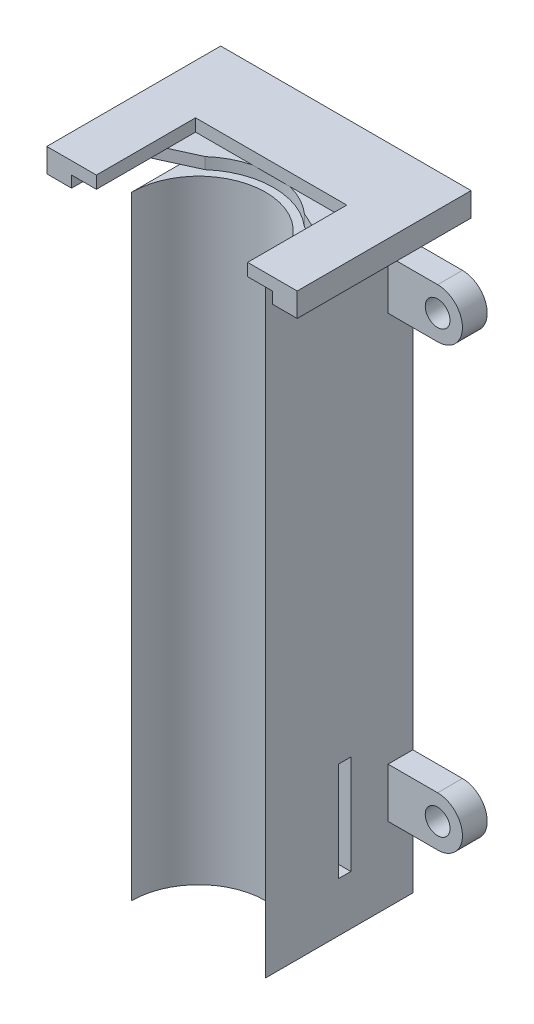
from build123d import *

# Parameters (mm, degrees)
BOSS_EXTRUDE1_DEPTH = 2.921
BOSS_EXTRUDE2_DEPTH = 3.175
BOSS_EXTRUDE3_DEPTH = 157.1625
SKETCH4_R           = 3.175
BOSS_EXTRUDE4_DEPTH = 6.35
SKETCH8_W           = 3.175
SKETCH8_H           = 25.4
CUT_EXTRUDE2_DEPTH  = 1641.301720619


with BuildPart() as part:
    # Sketch1 → Boss-Extrude1 (new body)
    with BuildSketch(Plane(origin=(0, 1004.350361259, 0), x_dir=(1, 0, 0), z_dir=(0, 1, 0))):
        with BuildLine():
            Line((357.540693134, -1279.66945996), (357.540693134, -1293.304768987))
            Line((357.540693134, -1293.304768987), (351.190693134, -1293.304768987))
            Line((351.190693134, -1293.304768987), (351.190693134, -1248.763034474))
            Line((351.190693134, -1248.763034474), (415.325693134, -1248.763034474))
            Line((415.325693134, -1248.763034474), (415.325693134, -1293.304768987))
            Line((415.325693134, -1293.304768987), (408.975693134, -1293.304768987))
            Line((408.975693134, -1293.304768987), (408.975693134, -1279.66945996))
            ThreePointArc((408.975693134, -1279.66945996), (408.572843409, -1278.296802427), (407.492079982, -1277.359558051))
            Line((407.492079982, -1277.359558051), (395.959386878, -1272.085314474))
            ThreePointArc((395.959386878, -1272.085314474), (383.258193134, -1267.284714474), (370.55699939, -1272.085314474))
            Line((370.55699939, -1272.085314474), (359.024306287, -1277.359558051))
            ThreePointArc((359.024306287, -1277.359558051), (357.94354286, -1278.296802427), (357.540693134, -1279.66945996))
        make_face()
    extrude(amount=-BOSS_EXTRUDE1_DEPTH)

    # Sketch2 → Boss-Extrude2 (add)
    with BuildSketch(Plane(origin=(0, 1004.350361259, 0), x_dir=(1, 0, 0), z_dir=(0, 1, 0))):
        Polygon((415.325693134, -1293.304768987), (402.625693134, -1293.304768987), (402.625693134, -1267.904768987), (363.890693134, -1267.904768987), (363.890693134, -1293.304768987), (351.190693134, -1293.304768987), (351.190693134, -1248.763034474), (415.325693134, -1248.763034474), align=None)
    extrude(amount=BOSS_EXTRUDE2_DEPTH)

    # Sketch3 → Boss-Extrude3 (add)
    with BuildSketch(Plane.XZ.offset(-1001.429361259)):
        with BuildLine():
            Line((366.113193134, 1286.487114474), (366.113193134, 1248.763034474))
            Line((366.113193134, 1248.763034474), (400.403193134, 1248.763034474))
            Line((400.403193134, 1248.763034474), (400.403193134, 1286.487114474))
            ThreePointArc((400.403193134, 1286.487114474), (383.258193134, 1269.342114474), (366.113193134, 1286.487114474))
        make_face()
    extrude(amount=BOSS_EXTRUDE3_DEPTH)

    # Sketch4 → Boss-Extrude4 (add)
    # profile 1 of 4: a face of its own
    with BuildSketch(Plane(origin=(0, 0, 1248.763034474), x_dir=(-1, 0, 0), z_dir=(0, 0, -1))):
        with BuildLine():
            Line((-400.403193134, 988.729361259), (-413.103193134, 988.729361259))
            ThreePointArc((-413.103193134, 988.729361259), (-419.453193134, 982.379361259), (-413.103193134, 976.029361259))
            Line((-413.103193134, 976.029361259), (-400.403193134, 976.029361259))
            Line((-400.403193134, 976.029361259), (-400.403193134, 988.729361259))
        make_face()
        with Locations(Location((-413.103193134, 982.379361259, 0), (0, 0, 90))):
            Circle(SKETCH4_R, mode=Mode.SUBTRACT)
    # profile 2 of 4: a face of its own
    with BuildSketch(Plane(origin=(0, 0, 1248.763034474), x_dir=(-1, 0, 0), z_dir=(0, 0, -1))):
        with BuildLine():
            Line((-366.113193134, 976.029361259), (-353.413193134, 976.029361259))
            ThreePointArc((-353.413193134, 976.029361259), (-347.063193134, 982.379361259), (-353.413193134, 988.729361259))
            Line((-353.413193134, 988.729361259), (-366.113193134, 988.729361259))
            Line((-366.113193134, 988.729361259), (-366.113193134, 976.029361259))
        make_face()
        with Locations(Location((-353.413193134, 982.379361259, 0), (0, 0, 270))):
            Circle(SKETCH4_R, mode=Mode.SUBTRACT)
    # profile 3 of 4: a face of its own
    with BuildSketch(Plane(origin=(0, 0, 1248.763034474), x_dir=(-1, 0, 0), z_dir=(0, 0, -1))):
        with BuildLine():
            Line((-400.403193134, 863.316861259), (-413.103193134, 863.316861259))
            ThreePointArc((-413.103193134, 863.316861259), (-419.453193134, 869.666861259), (-413.103193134, 876.016861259))
            Line((-413.103193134, 876.016861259), (-400.403193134, 876.016861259))
            Line((-400.403193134, 876.016861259), (-400.403193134, 863.316861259))
        make_face()
        with Locations(Location((-413.103193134, 869.666861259, 0), (0, 0, 90))):
            Circle(SKETCH4_R, mode=Mode.SUBTRACT)
    # profile 4 of 4: a face of its own
    with BuildSketch(Plane(origin=(0, 0, 1248.763034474), x_dir=(-1, 0, 0), z_dir=(0, 0, -1))):
        with BuildLine():
            Line((-366.113193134, 876.016861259), (-366.113193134, 863.316861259))
            Line((-366.113193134, 863.316861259), (-353.413193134, 863.316861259))
            ThreePointArc((-353.413193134, 863.316861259), (-347.063193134, 869.666861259), (-353.413193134, 876.016861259))
            Line((-353.413193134, 876.016861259), (-366.113193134, 876.016861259))
        make_face()
        with Locations(Location((-353.413193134, 869.666861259, 0), (0, 0, 270))):
            Circle(SKETCH4_R, mode=Mode.SUBTRACT)
    extrude(amount=-BOSS_EXTRUDE4_DEPTH)

    # Sketch8 → Cut-Extrude2 (cut, through all)
    with BuildSketch(Plane(origin=(400.403193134, 0, 0), x_dir=(0, 0, -1), z_dir=(1, 0, 0))):
        with Locations((-1266.225534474, 869.666861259)):
            Rectangle(SKETCH8_W, SKETCH8_H)
    extrude(amount=-CUT_EXTRUDE2_DEPTH, mode=Mode.SUBTRACT)


solid = part.part
